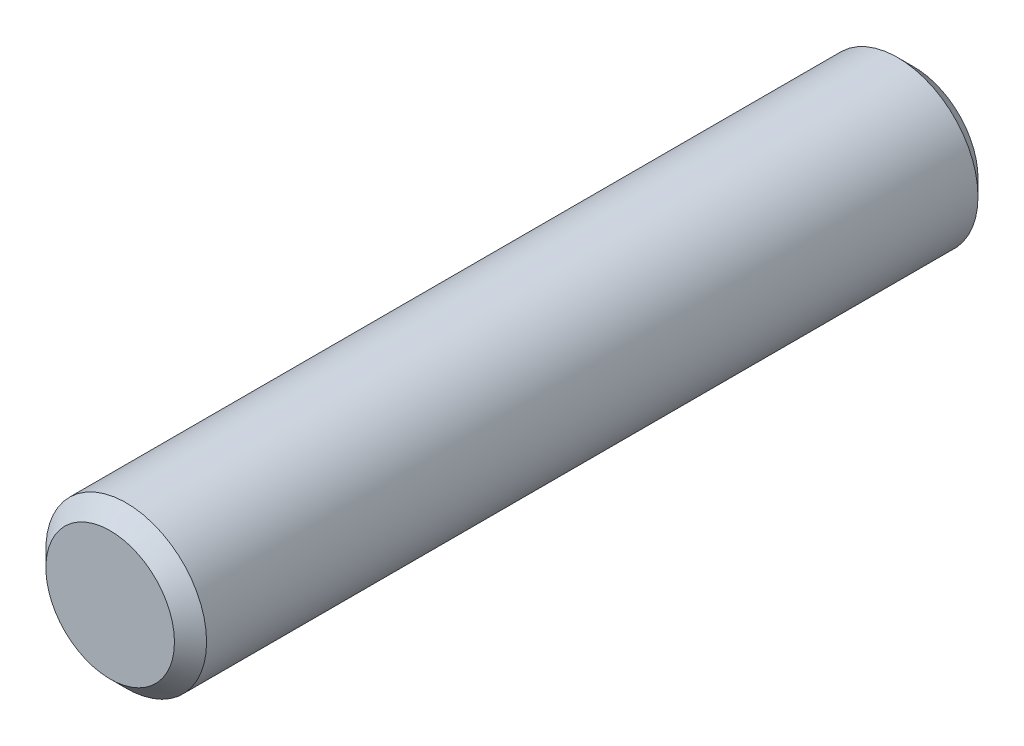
from build123d import *

# Parameters (mm, degrees)
ESQUISSE1_R          = 10
BASE_EXTRUSION_DEPTH = 100
CHANFREIN1_SIZE      = 2


with BuildPart() as part:
    # Esquisse1 → Base-Extrusion (new body)
    with BuildSketch(Plane.XY):
        Circle(ESQUISSE1_R)
    extrude(amount=BASE_EXTRUSION_DEPTH)

    # Chanfrein1
    chanfrein1_edges = [part.edges().sort_by_distance(p)[0] for p in [
        (-10, 0, 0),
        (-10, 0, 100),
    ]]
    chamfer(chanfrein1_edges, length=CHANFREIN1_SIZE)


solid = part.part
